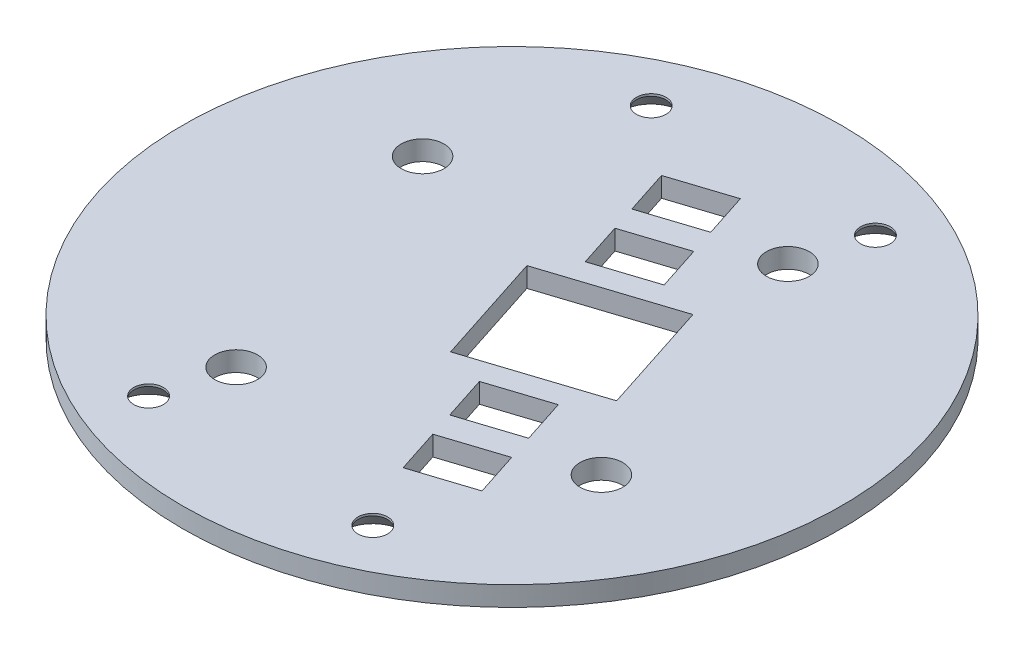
ISO-10303-21;
HEADER;
FILE_DESCRIPTION(('STEP AP214'),'2;1');
FILE_NAME('part.step','',(''),(''),'','','');
FILE_SCHEMA(('AUTOMOTIVE_DESIGN { 1 0 10303 214 1 1 1 1 }'));
ENDSEC;
DATA;
#1=APPLICATION_CONTEXT('core data for automotive mechanical design processes');
#2=APPLICATION_PROTOCOL_DEFINITION('international standard','automotive_design',2000,#1);
#3=PRODUCT_CONTEXT('',#1,'mechanical');
#4=PRODUCT('Part','Part','',(#3));
#5=PRODUCT_RELATED_PRODUCT_CATEGORY('part','',(#4));
#6=PRODUCT_DEFINITION_FORMATION('','',#4);
#7=PRODUCT_DEFINITION_CONTEXT('part definition',#1,'design');
#8=PRODUCT_DEFINITION('design','',#6,#7);
#9=PRODUCT_DEFINITION_SHAPE('','',#8);
#10=(LENGTH_UNIT() NAMED_UNIT(*) SI_UNIT(.MILLI.,.METRE.));
#11=(NAMED_UNIT(*) PLANE_ANGLE_UNIT() SI_UNIT($,.RADIAN.));
#12=(NAMED_UNIT(*) SI_UNIT($,.STERADIAN.) SOLID_ANGLE_UNIT());
#13=UNCERTAINTY_MEASURE_WITH_UNIT(LENGTH_MEASURE(1.E-05),#10,'distance_accuracy_value','');
#14=(GEOMETRIC_REPRESENTATION_CONTEXT(3) GLOBAL_UNCERTAINTY_ASSIGNED_CONTEXT((#13)) GLOBAL_UNIT_ASSIGNED_CONTEXT((#10,
#11,#12)) REPRESENTATION_CONTEXT('',''));
#15=CARTESIAN_POINT('',(0.,0.,0.));
#16=DIRECTION('',(0.,0.,1.));
#17=DIRECTION('',(1.,0.,0.));
#18=AXIS2_PLACEMENT_3D('',#15,#16,#17);
#19=CARTESIAN_POINT('',(0.,1.5,0.));
#20=DIRECTION('',(0.,1.,0.));
#21=DIRECTION('',(0.,0.,1.));
#22=AXIS2_PLACEMENT_3D('',#19,#20,#21);
#23=PLANE('',#22);
#24=DIRECTION('',(0.308303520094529,0.,0.951288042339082));
#25=VECTOR('',#24,1.);
#26=CARTESIAN_POINT('',(13.5874226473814,1.5,-13.8644129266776));
#27=LINE('',#26,#25);
#28=CARTESIAN_POINT('',(13.5874226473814,1.5,-13.8644129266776));
#29=VERTEX_POINT('',#28);
#30=CARTESIAN_POINT('',(19.136886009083,1.5,3.25877183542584));
#31=VERTEX_POINT('',#30);
#32=EDGE_CURVE('E174',#29,#31,#27,.T.);
#33=ORIENTED_EDGE('',*,*,#32,.T.);
#34=DIRECTION('',(-0.951288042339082,0.,0.308303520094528));
#35=VECTOR('',#34,1.);
#36=CARTESIAN_POINT('',(19.136886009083,1.5,3.25877183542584));
#37=LINE('',#36,#35);
#38=CARTESIAN_POINT('',(0.111125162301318,1.5,9.42484223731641));
#39=VERTEX_POINT('',#38);
#40=EDGE_CURVE('E183',#31,#39,#37,.T.);
#41=ORIENTED_EDGE('',*,*,#40,.T.);
#42=DIRECTION('',(-0.308303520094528,0.,-0.951288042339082));
#43=VECTOR('',#42,1.);
#44=CARTESIAN_POINT('',(0.111125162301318,1.5,9.42484223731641));
#45=LINE('',#44,#43);
#46=CARTESIAN_POINT('',(-5.43833819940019,1.5,-7.69834252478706));
#47=VERTEX_POINT('',#46);
#48=EDGE_CURVE('E50',#39,#47,#45,.T.);
#49=ORIENTED_EDGE('',*,*,#48,.T.);
#50=DIRECTION('',(0.951288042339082,0.,-0.308303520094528));
#51=VECTOR('',#50,1.);
#52=CARTESIAN_POINT('',(-5.43833819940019,1.5,-7.69834252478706));
#53=LINE('',#52,#51);
#54=EDGE_CURVE('E180',#47,#29,#53,.T.);
#55=ORIENTED_EDGE('',*,*,#54,.T.);
#56=EDGE_LOOP('',(#33,#41,#49,#55));
#57=FACE_BOUND('',#56,.T.);
#58=CARTESIAN_POINT('',(17.0092592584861,1.5,38.1280421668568));
#59=DIRECTION('',(0.,-1.,0.));
#60=DIRECTION('',(0.,0.,-1.));
#61=AXIS2_PLACEMENT_3D('',#58,#59,#60);
#62=CIRCLE('',#61,2.2479);
#63=CARTESIAN_POINT('',(17.0092592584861,1.5,35.8801421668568));
#64=VERTEX_POINT('',#63);
#65=EDGE_CURVE('E213',#64,#64,#62,.T.);
#66=ORIENTED_EDGE('',*,*,#65,.T.);
#67=EDGE_LOOP('',(#66));
#68=FACE_BOUND('',#67,.T.);
#69=CARTESIAN_POINT('',(-17.0092592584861,1.5,38.1280421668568));
#70=DIRECTION('',(0.,-1.,0.));
#71=DIRECTION('',(0.,0.,-1.));
#72=AXIS2_PLACEMENT_3D('',#69,#70,#71);
#73=CIRCLE('',#72,2.2479);
#74=CARTESIAN_POINT('',(-17.0092592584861,1.5,35.8801421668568));
#75=VERTEX_POINT('',#74);
#76=EDGE_CURVE('E222',#75,#75,#73,.T.);
#77=ORIENTED_EDGE('',*,*,#76,.T.);
#78=EDGE_LOOP('',(#77));
#79=FACE_BOUND('',#78,.T.);
#80=CARTESIAN_POINT('',(-17.009259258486,1.5,-38.1280421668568));
#81=DIRECTION('',(0.,-1.,0.));
#82=DIRECTION('',(0.,0.,-1.));
#83=AXIS2_PLACEMENT_3D('',#80,#81,#82);
#84=CIRCLE('',#83,2.2479);
#85=CARTESIAN_POINT('',(-17.009259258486,1.5,-40.3759421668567));
#86=VERTEX_POINT('',#85);
#87=EDGE_CURVE('E231',#86,#86,#84,.T.);
#88=ORIENTED_EDGE('',*,*,#87,.T.);
#89=EDGE_LOOP('',(#88));
#90=FACE_BOUND('',#89,.T.);
#91=CARTESIAN_POINT('',(0.,1.5,0.));
#92=DIRECTION('',(0.,1.,0.));
#93=DIRECTION('',(0.,0.,1.));
#94=AXIS2_PLACEMENT_3D('',#91,#92,#93);
#95=CIRCLE('',#94,50.);
#96=CARTESIAN_POINT('',(0.,1.5,50.));
#97=VERTEX_POINT('',#96);
#98=EDGE_CURVE('E243',#97,#97,#95,.T.);
#99=ORIENTED_EDGE('',*,*,#98,.T.);
#100=EDGE_LOOP('',(#99));
#101=FACE_BOUND('',#100,.T.);
#102=CARTESIAN_POINT('',(-14.1456594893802,1.5,27.7110143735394));
#103=DIRECTION('',(0.,1.,0.));
#104=DIRECTION('',(0.,0.,1.));
#105=AXIS2_PLACEMENT_3D('',#102,#103,#104);
#106=CIRCLE('',#105,3.25);
#107=CARTESIAN_POINT('',(-14.1456594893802,1.5,30.9610143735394));
#108=VERTEX_POINT('',#107);
#109=EDGE_CURVE('E39',#108,#108,#106,.T.);
#110=ORIENTED_EDGE('',*,*,#109,.F.);
#111=EDGE_LOOP('',(#110));
#112=FACE_BOUND('',#111,.T.);
#113=DIRECTION('',(0.308303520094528,0.,0.951288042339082));
#114=VECTOR('',#113,1.);
#115=CARTESIAN_POINT('',(6.17982515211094,1.5,11.1214875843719));
#116=LINE('',#115,#114);
#117=CARTESIAN_POINT('',(6.17982515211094,1.5,11.1214875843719));
#118=VERTEX_POINT('',#117);
#119=CARTESIAN_POINT('',(8.33794979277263,1.5,17.7805038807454));
#120=VERTEX_POINT('',#119);
#121=EDGE_CURVE('E361',#118,#120,#116,.T.);
#122=ORIENTED_EDGE('',*,*,#121,.F.);
#123=DIRECTION('',(-0.951288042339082,0.,0.308303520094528));
#124=VECTOR('',#123,1.);
#125=CARTESIAN_POINT('',(15.2170615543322,1.5,8.19260414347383));
#126=LINE('',#125,#124);
#127=CARTESIAN_POINT('',(15.2170615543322,1.5,8.19260414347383));
#128=VERTEX_POINT('',#127);
#129=EDGE_CURVE('E368',#128,#118,#126,.T.);
#130=ORIENTED_EDGE('',*,*,#129,.F.);
#131=DIRECTION('',(-0.308303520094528,0.,-0.951288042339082));
#132=VECTOR('',#131,1.);
#133=CARTESIAN_POINT('',(17.3751861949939,1.5,14.8516204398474));
#134=LINE('',#133,#132);
#135=CARTESIAN_POINT('',(17.3751861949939,1.5,14.8516204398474));
#136=VERTEX_POINT('',#135);
#137=EDGE_CURVE('E382',#136,#128,#134,.T.);
#138=ORIENTED_EDGE('',*,*,#137,.F.);
#139=DIRECTION('',(0.951288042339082,0.,-0.308303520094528));
#140=VECTOR('',#139,1.);
#141=CARTESIAN_POINT('',(8.33794979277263,1.5,17.7805038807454));
#142=LINE('',#141,#140);
#143=EDGE_CURVE('E379',#120,#136,#142,.T.);
#144=ORIENTED_EDGE('',*,*,#143,.F.);
#145=EDGE_LOOP('',(#122,#130,#138,#144));
#146=FACE_BOUND('',#145,.T.);
#147=CARTESIAN_POINT('',(-27.7110143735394,1.5,-14.1456594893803));
#148=DIRECTION('',(0.,1.,0.));
#149=DIRECTION('',(0.,0.,1.));
#150=AXIS2_PLACEMENT_3D('',#147,#148,#149);
#151=CIRCLE('',#150,3.25);
#152=CARTESIAN_POINT('',(-27.7110143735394,1.5,-10.8956594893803));
#153=VERTEX_POINT('',#152);
#154=EDGE_CURVE('E355',#153,#153,#151,.T.);
#155=ORIENTED_EDGE('',*,*,#154,.F.);
#156=EDGE_LOOP('',(#155));
#157=FACE_BOUND('',#156,.T.);
#158=CARTESIAN_POINT('',(14.1456594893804,1.5,-27.7110143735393));
#159=DIRECTION('',(0.,1.,0.));
#160=DIRECTION('',(0.,0.,1.));
#161=AXIS2_PLACEMENT_3D('',#158,#159,#160);
#162=CIRCLE('',#161,3.25);
#163=CARTESIAN_POINT('',(14.1456594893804,1.5,-24.4610143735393));
#164=VERTEX_POINT('',#163);
#165=EDGE_CURVE('E349',#164,#164,#162,.T.);
#166=ORIENTED_EDGE('',*,*,#165,.F.);
#167=EDGE_LOOP('',(#166));
#168=FACE_BOUND('',#167,.T.);
#169=CARTESIAN_POINT('',(27.7110143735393,1.5,14.1456594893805));
#170=DIRECTION('',(0.,1.,0.));
#171=DIRECTION('',(0.,0.,1.));
#172=AXIS2_PLACEMENT_3D('',#169,#170,#171);
#173=CIRCLE('',#172,3.25);
#174=CARTESIAN_POINT('',(27.7110143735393,1.5,17.3956594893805));
#175=VERTEX_POINT('',#174);
#176=EDGE_CURVE('E339',#175,#175,#173,.T.);
#177=ORIENTED_EDGE('',*,*,#176,.F.);
#178=EDGE_LOOP('',(#177));
#179=FACE_BOUND('',#178,.T.);
#180=DIRECTION('',(0.308303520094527,0.,0.951288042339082));
#181=VECTOR('',#180,1.);
#182=CARTESIAN_POINT('',(11.7292885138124,1.5,28.2446723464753));
#183=LINE('',#182,#181);
#184=CARTESIAN_POINT('',(9.57116387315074,1.5,21.5856560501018));
#185=VERTEX_POINT('',#184);
#186=CARTESIAN_POINT('',(11.7292885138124,1.5,28.2446723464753));
#187=VERTEX_POINT('',#186);
#188=EDGE_CURVE('E307',#185,#187,#183,.T.);
#189=ORIENTED_EDGE('',*,*,#188,.F.);
#190=DIRECTION('',(-0.951288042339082,0.,0.308303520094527));
#191=VECTOR('',#190,1.);
#192=CARTESIAN_POINT('',(9.57116387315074,1.5,21.5856560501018));
#193=LINE('',#192,#191);
#194=CARTESIAN_POINT('',(18.608400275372,1.5,18.6567726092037));
#195=VERTEX_POINT('',#194);
#196=EDGE_CURVE('E318',#195,#185,#193,.T.);
#197=ORIENTED_EDGE('',*,*,#196,.F.);
#198=DIRECTION('',(-0.308303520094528,0.,-0.951288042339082));
#199=VECTOR('',#198,1.);
#200=CARTESIAN_POINT('',(18.608400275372,1.5,18.6567726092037));
#201=LINE('',#200,#199);
#202=CARTESIAN_POINT('',(20.7665249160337,1.5,25.3157889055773));
#203=VERTEX_POINT('',#202);
#204=EDGE_CURVE('E332',#203,#195,#201,.T.);
#205=ORIENTED_EDGE('',*,*,#204,.F.);
#206=DIRECTION('',(0.951288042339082,0.,-0.308303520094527));
#207=VECTOR('',#206,1.);
#208=CARTESIAN_POINT('',(20.7665249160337,1.5,25.3157889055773));
#209=LINE('',#208,#207);
#210=EDGE_CURVE('E329',#187,#203,#209,.T.);
#211=ORIENTED_EDGE('',*,*,#210,.F.);
#212=EDGE_LOOP('',(#189,#197,#205,#211));
#213=FACE_BOUND('',#212,.T.);
#214=DIRECTION('',(-0.308303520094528,0.,-0.951288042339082));
#215=VECTOR('',#214,1.);
#216=CARTESIAN_POINT('',(5.36059801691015,1.5,-22.2200745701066));
#217=LINE('',#216,#215);
#218=CARTESIAN_POINT('',(7.51872265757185,1.5,-15.5610582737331));
#219=VERTEX_POINT('',#218);
#220=CARTESIAN_POINT('',(5.36059801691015,1.5,-22.2200745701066));
#221=VERTEX_POINT('',#220);
#222=EDGE_CURVE('E275',#219,#221,#217,.T.);
#223=ORIENTED_EDGE('',*,*,#222,.F.);
#224=DIRECTION('',(0.951288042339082,0.,-0.308303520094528));
#225=VECTOR('',#224,1.);
#226=CARTESIAN_POINT('',(7.51872265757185,1.5,-15.5610582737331));
#227=LINE('',#226,#225);
#228=CARTESIAN_POINT('',(-1.51851374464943,1.5,-12.632174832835));
#229=VERTEX_POINT('',#228);
#230=EDGE_CURVE('E286',#229,#219,#227,.T.);
#231=ORIENTED_EDGE('',*,*,#230,.F.);
#232=DIRECTION('',(0.308303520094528,0.,0.951288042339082));
#233=VECTOR('',#232,1.);
#234=CARTESIAN_POINT('',(-1.51851374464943,1.5,-12.632174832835));
#235=LINE('',#234,#233);
#236=CARTESIAN_POINT('',(-3.67663838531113,1.5,-19.2911911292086));
#237=VERTEX_POINT('',#236);
#238=EDGE_CURVE('E300',#237,#229,#235,.T.);
#239=ORIENTED_EDGE('',*,*,#238,.F.);
#240=DIRECTION('',(-0.951288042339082,0.,0.308303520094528));
#241=VECTOR('',#240,1.);
#242=CARTESIAN_POINT('',(-3.67663838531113,1.5,-19.2911911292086));
#243=LINE('',#242,#241);
#244=EDGE_CURVE('E297',#221,#237,#243,.T.);
#245=ORIENTED_EDGE('',*,*,#244,.F.);
#246=EDGE_LOOP('',(#223,#231,#239,#245));
#247=FACE_BOUND('',#246,.T.);
#248=DIRECTION('',(0.308303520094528,0.,0.951288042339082));
#249=VECTOR('',#248,1.);
#250=CARTESIAN_POINT('',(-7.06797710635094,1.5,-29.7553595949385));
#251=LINE('',#250,#249);
#252=CARTESIAN_POINT('',(-7.06797710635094,1.5,-29.7553595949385));
#253=VERTEX_POINT('',#252);
#254=CARTESIAN_POINT('',(-4.90985246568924,1.5,-23.0963432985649));
#255=VERTEX_POINT('',#254);
#256=EDGE_CURVE('E247',#253,#255,#251,.T.);
#257=ORIENTED_EDGE('',*,*,#256,.F.);
#258=DIRECTION('',(-0.951288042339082,0.,0.308303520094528));
#259=VECTOR('',#258,1.);
#260=CARTESIAN_POINT('',(1.96925929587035,1.5,-32.6842430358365));
#261=LINE('',#260,#259);
#262=CARTESIAN_POINT('',(1.96925929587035,1.5,-32.6842430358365));
#263=VERTEX_POINT('',#262);
#264=EDGE_CURVE('E254',#263,#253,#261,.T.);
#265=ORIENTED_EDGE('',*,*,#264,.F.);
#266=DIRECTION('',(-0.308303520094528,0.,-0.951288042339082));
#267=VECTOR('',#266,1.);
#268=CARTESIAN_POINT('',(4.12738393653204,1.5,-26.025226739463));
#269=LINE('',#268,#267);
#270=CARTESIAN_POINT('',(4.12738393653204,1.5,-26.025226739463));
#271=VERTEX_POINT('',#270);
#272=EDGE_CURVE('E268',#271,#263,#269,.T.);
#273=ORIENTED_EDGE('',*,*,#272,.F.);
#274=DIRECTION('',(0.951288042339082,0.,-0.308303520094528));
#275=VECTOR('',#274,1.);
#276=CARTESIAN_POINT('',(-4.90985246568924,1.5,-23.0963432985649));
#277=LINE('',#276,#275);
#278=EDGE_CURVE('E265',#255,#271,#277,.T.);
#279=ORIENTED_EDGE('',*,*,#278,.F.);
#280=EDGE_LOOP('',(#257,#265,#273,#279));
#281=FACE_BOUND('',#280,.T.);
#282=CARTESIAN_POINT('',(17.009259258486,1.5,-38.1280421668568));
#283=DIRECTION('',(0.,-1.,0.));
#284=DIRECTION('',(0.,0.,-1.));
#285=AXIS2_PLACEMENT_3D('',#282,#283,#284);
#286=CIRCLE('',#285,2.2479);
#287=CARTESIAN_POINT('',(17.009259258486,1.5,-40.3759421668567));
#288=VERTEX_POINT('',#287);
#289=EDGE_CURVE('E240',#288,#288,#286,.T.);
#290=ORIENTED_EDGE('',*,*,#289,.T.);
#291=EDGE_LOOP('',(#290));
#292=FACE_BOUND('',#291,.T.);
#293=ADVANCED_FACE('F35',(#57,#68,#79,#90,#101,#112,#146,#157,#168,#179,#213,#247,#281,#292),
#23,.T.);
#294=CARTESIAN_POINT('',(0.,-1.5,0.));
#295=DIRECTION('',(0.,1.,0.));
#296=DIRECTION('',(0.,0.,1.));
#297=AXIS2_PLACEMENT_3D('',#294,#295,#296);
#298=PLANE('',#297);
#299=DIRECTION('',(-0.951288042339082,0.,0.308303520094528));
#300=VECTOR('',#299,1.);
#301=CARTESIAN_POINT('',(19.136886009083,-1.5,3.25877183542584));
#302=LINE('',#301,#300);
#303=CARTESIAN_POINT('',(19.136886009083,-1.5,3.25877183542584));
#304=VERTEX_POINT('',#303);
#305=CARTESIAN_POINT('',(0.111125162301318,-1.5,9.42484223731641));
#306=VERTEX_POINT('',#305);
#307=EDGE_CURVE('E198',#304,#306,#302,.T.);
#308=ORIENTED_EDGE('',*,*,#307,.F.);
#309=DIRECTION('',(0.308303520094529,0.,0.951288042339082));
#310=VECTOR('',#309,1.);
#311=CARTESIAN_POINT('',(13.5874226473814,-1.5,-13.8644129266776));
#312=LINE('',#311,#310);
#313=CARTESIAN_POINT('',(13.5874226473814,-1.5,-13.8644129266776));
#314=VERTEX_POINT('',#313);
#315=EDGE_CURVE('E58',#314,#304,#312,.T.);
#316=ORIENTED_EDGE('',*,*,#315,.F.);
#317=DIRECTION('',(0.951288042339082,0.,-0.308303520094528));
#318=VECTOR('',#317,1.);
#319=CARTESIAN_POINT('',(-5.43833819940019,-1.5,-7.69834252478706));
#320=LINE('',#319,#318);
#321=CARTESIAN_POINT('',(-5.43833819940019,-1.5,-7.69834252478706));
#322=VERTEX_POINT('',#321);
#323=EDGE_CURVE('E189',#322,#314,#320,.T.);
#324=ORIENTED_EDGE('',*,*,#323,.F.);
#325=DIRECTION('',(-0.308303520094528,0.,-0.951288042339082));
#326=VECTOR('',#325,1.);
#327=CARTESIAN_POINT('',(0.111125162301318,-1.5,9.42484223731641));
#328=LINE('',#327,#326);
#329=EDGE_CURVE('E192',#306,#322,#328,.T.);
#330=ORIENTED_EDGE('',*,*,#329,.F.);
#331=EDGE_LOOP('',(#308,#316,#324,#330));
#332=FACE_BOUND('',#331,.T.);
#333=CARTESIAN_POINT('',(17.0092592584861,-1.5,38.1280421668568));
#334=DIRECTION('',(0.,-1.,0.));
#335=DIRECTION('',(0.,0.,-1.));
#336=AXIS2_PLACEMENT_3D('',#333,#334,#335);
#337=CIRCLE('',#336,4.5593);
#338=CARTESIAN_POINT('',(17.0092592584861,-1.5,33.5687421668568));
#339=VERTEX_POINT('',#338);
#340=EDGE_CURVE('E204',#339,#339,#337,.T.);
#341=ORIENTED_EDGE('',*,*,#340,.F.);
#342=EDGE_LOOP('',(#341));
#343=FACE_BOUND('',#342,.T.);
#344=CARTESIAN_POINT('',(-17.0092592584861,-1.5,38.1280421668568));
#345=DIRECTION('',(0.,-1.,0.));
#346=DIRECTION('',(0.,0.,-1.));
#347=AXIS2_PLACEMENT_3D('',#344,#345,#346);
#348=CIRCLE('',#347,4.5593);
#349=CARTESIAN_POINT('',(-17.0092592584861,-1.5,33.5687421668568));
#350=VERTEX_POINT('',#349);
#351=EDGE_CURVE('E216',#350,#350,#348,.T.);
#352=ORIENTED_EDGE('',*,*,#351,.F.);
#353=EDGE_LOOP('',(#352));
#354=FACE_BOUND('',#353,.T.);
#355=CARTESIAN_POINT('',(-17.009259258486,-1.5,-38.1280421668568));
#356=DIRECTION('',(0.,-1.,0.));
#357=DIRECTION('',(0.,0.,-1.));
#358=AXIS2_PLACEMENT_3D('',#355,#356,#357);
#359=CIRCLE('',#358,4.5593);
#360=CARTESIAN_POINT('',(-17.009259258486,-1.5,-42.6873421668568));
#361=VERTEX_POINT('',#360);
#362=EDGE_CURVE('E225',#361,#361,#359,.T.);
#363=ORIENTED_EDGE('',*,*,#362,.F.);
#364=EDGE_LOOP('',(#363));
#365=FACE_BOUND('',#364,.T.);
#366=CARTESIAN_POINT('',(0.,-1.5,0.));
#367=DIRECTION('',(0.,1.,0.));
#368=DIRECTION('',(0.,0.,1.));
#369=AXIS2_PLACEMENT_3D('',#366,#367,#368);
#370=CIRCLE('',#369,50.);
#371=CARTESIAN_POINT('',(0.,-1.5,50.));
#372=VERTEX_POINT('',#371);
#373=EDGE_CURVE('E244',#372,#372,#370,.F.);
#374=ORIENTED_EDGE('',*,*,#373,.T.);
#375=EDGE_LOOP('',(#374));
#376=FACE_BOUND('',#375,.T.);
#377=CARTESIAN_POINT('',(-14.1456594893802,-1.5,27.7110143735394));
#378=DIRECTION('',(0.,1.,0.));
#379=DIRECTION('',(0.,0.,1.));
#380=AXIS2_PLACEMENT_3D('',#377,#378,#379);
#381=CIRCLE('',#380,3.25);
#382=CARTESIAN_POINT('',(-14.1456594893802,-1.5,30.9610143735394));
#383=VERTEX_POINT('',#382);
#384=EDGE_CURVE('E11',#383,#383,#381,.T.);
#385=ORIENTED_EDGE('',*,*,#384,.T.);
#386=EDGE_LOOP('',(#385));
#387=FACE_BOUND('',#386,.T.);
#388=DIRECTION('',(-0.951288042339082,0.,0.308303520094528));
#389=VECTOR('',#388,1.);
#390=CARTESIAN_POINT('',(15.2170615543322,-1.5,8.19260414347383));
#391=LINE('',#390,#389);
#392=CARTESIAN_POINT('',(15.2170615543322,-1.5,8.19260414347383));
#393=VERTEX_POINT('',#392);
#394=CARTESIAN_POINT('',(6.17982515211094,-1.5,11.1214875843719));
#395=VERTEX_POINT('',#394);
#396=EDGE_CURVE('E374',#393,#395,#391,.T.);
#397=ORIENTED_EDGE('',*,*,#396,.T.);
#398=DIRECTION('',(0.308303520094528,0.,0.951288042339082));
#399=VECTOR('',#398,1.);
#400=CARTESIAN_POINT('',(6.17982515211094,-1.5,11.1214875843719));
#401=LINE('',#400,#399);
#402=CARTESIAN_POINT('',(8.33794979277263,-1.5,17.7805038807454));
#403=VERTEX_POINT('',#402);
#404=EDGE_CURVE('E364',#395,#403,#401,.T.);
#405=ORIENTED_EDGE('',*,*,#404,.T.);
#406=DIRECTION('',(0.951288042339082,0.,-0.308303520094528));
#407=VECTOR('',#406,1.);
#408=CARTESIAN_POINT('',(8.33794979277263,-1.5,17.7805038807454));
#409=LINE('',#408,#407);
#410=CARTESIAN_POINT('',(17.3751861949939,-1.5,14.8516204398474));
#411=VERTEX_POINT('',#410);
#412=EDGE_CURVE('E367',#403,#411,#409,.T.);
#413=ORIENTED_EDGE('',*,*,#412,.T.);
#414=DIRECTION('',(-0.308303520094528,0.,-0.951288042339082));
#415=VECTOR('',#414,1.);
#416=CARTESIAN_POINT('',(17.3751861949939,-1.5,14.8516204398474));
#417=LINE('',#416,#415);
#418=EDGE_CURVE('E371',#411,#393,#417,.T.);
#419=ORIENTED_EDGE('',*,*,#418,.T.);
#420=EDGE_LOOP('',(#397,#405,#413,#419));
#421=FACE_BOUND('',#420,.T.);
#422=CARTESIAN_POINT('',(-27.7110143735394,-1.5,-14.1456594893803));
#423=DIRECTION('',(0.,1.,0.));
#424=DIRECTION('',(0.,0.,1.));
#425=AXIS2_PLACEMENT_3D('',#422,#423,#424);
#426=CIRCLE('',#425,3.25);
#427=CARTESIAN_POINT('',(-27.7110143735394,-1.5,-10.8956594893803));
#428=VERTEX_POINT('',#427);
#429=EDGE_CURVE('E358',#428,#428,#426,.T.);
#430=ORIENTED_EDGE('',*,*,#429,.T.);
#431=EDGE_LOOP('',(#430));
#432=FACE_BOUND('',#431,.T.);
#433=CARTESIAN_POINT('',(14.1456594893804,-1.5,-27.7110143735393));
#434=DIRECTION('',(0.,1.,0.));
#435=DIRECTION('',(0.,0.,1.));
#436=AXIS2_PLACEMENT_3D('',#433,#434,#435);
#437=CIRCLE('',#436,3.25);
#438=CARTESIAN_POINT('',(14.1456594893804,-1.5,-24.4610143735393));
#439=VERTEX_POINT('',#438);
#440=EDGE_CURVE('E352',#439,#439,#437,.T.);
#441=ORIENTED_EDGE('',*,*,#440,.T.);
#442=EDGE_LOOP('',(#441));
#443=FACE_BOUND('',#442,.T.);
#444=CARTESIAN_POINT('',(27.7110143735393,-1.5,14.1456594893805));
#445=DIRECTION('',(0.,1.,0.));
#446=DIRECTION('',(0.,0.,1.));
#447=AXIS2_PLACEMENT_3D('',#444,#445,#446);
#448=CIRCLE('',#447,3.25);
#449=CARTESIAN_POINT('',(27.7110143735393,-1.5,17.3956594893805));
#450=VERTEX_POINT('',#449);
#451=EDGE_CURVE('E346',#450,#450,#448,.T.);
#452=ORIENTED_EDGE('',*,*,#451,.T.);
#453=EDGE_LOOP('',(#452));
#454=FACE_BOUND('',#453,.T.);
#455=DIRECTION('',(-0.951288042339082,0.,0.308303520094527));
#456=VECTOR('',#455,1.);
#457=CARTESIAN_POINT('',(9.57116387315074,-1.5,21.5856560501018));
#458=LINE('',#457,#456);
#459=CARTESIAN_POINT('',(18.608400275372,-1.5,18.6567726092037));
#460=VERTEX_POINT('',#459);
#461=CARTESIAN_POINT('',(9.57116387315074,-1.5,21.5856560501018));
#462=VERTEX_POINT('',#461);
#463=EDGE_CURVE('E324',#460,#462,#458,.T.);
#464=ORIENTED_EDGE('',*,*,#463,.T.);
#465=DIRECTION('',(0.308303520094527,0.,0.951288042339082));
#466=VECTOR('',#465,1.);
#467=CARTESIAN_POINT('',(11.7292885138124,-1.5,28.2446723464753));
#468=LINE('',#467,#466);
#469=CARTESIAN_POINT('',(11.7292885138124,-1.5,28.2446723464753));
#470=VERTEX_POINT('',#469);
#471=EDGE_CURVE('E314',#462,#470,#468,.T.);
#472=ORIENTED_EDGE('',*,*,#471,.T.);
#473=DIRECTION('',(0.951288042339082,0.,-0.308303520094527));
#474=VECTOR('',#473,1.);
#475=CARTESIAN_POINT('',(20.7665249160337,-1.5,25.3157889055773));
#476=LINE('',#475,#474);
#477=CARTESIAN_POINT('',(20.7665249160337,-1.5,25.3157889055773));
#478=VERTEX_POINT('',#477);
#479=EDGE_CURVE('E317',#470,#478,#476,.T.);
#480=ORIENTED_EDGE('',*,*,#479,.T.);
#481=DIRECTION('',(-0.308303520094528,0.,-0.951288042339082));
#482=VECTOR('',#481,1.);
#483=CARTESIAN_POINT('',(18.608400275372,-1.5,18.6567726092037));
#484=LINE('',#483,#482);
#485=EDGE_CURVE('E321',#478,#460,#484,.T.);
#486=ORIENTED_EDGE('',*,*,#485,.T.);
#487=EDGE_LOOP('',(#464,#472,#480,#486));
#488=FACE_BOUND('',#487,.T.);
#489=DIRECTION('',(0.951288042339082,0.,-0.308303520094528));
#490=VECTOR('',#489,1.);
#491=CARTESIAN_POINT('',(7.51872265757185,-1.5,-15.5610582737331));
#492=LINE('',#491,#490);
#493=CARTESIAN_POINT('',(-1.51851374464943,-1.5,-12.632174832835));
#494=VERTEX_POINT('',#493);
#495=CARTESIAN_POINT('',(7.51872265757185,-1.5,-15.5610582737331));
#496=VERTEX_POINT('',#495);
#497=EDGE_CURVE('E292',#494,#496,#492,.T.);
#498=ORIENTED_EDGE('',*,*,#497,.T.);
#499=DIRECTION('',(-0.308303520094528,0.,-0.951288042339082));
#500=VECTOR('',#499,1.);
#501=CARTESIAN_POINT('',(5.36059801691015,-1.5,-22.2200745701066));
#502=LINE('',#501,#500);
#503=CARTESIAN_POINT('',(5.36059801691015,-1.5,-22.2200745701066));
#504=VERTEX_POINT('',#503);
#505=EDGE_CURVE('E282',#496,#504,#502,.T.);
#506=ORIENTED_EDGE('',*,*,#505,.T.);
#507=DIRECTION('',(-0.951288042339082,0.,0.308303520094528));
#508=VECTOR('',#507,1.);
#509=CARTESIAN_POINT('',(-3.67663838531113,-1.5,-19.2911911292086));
#510=LINE('',#509,#508);
#511=CARTESIAN_POINT('',(-3.67663838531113,-1.5,-19.2911911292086));
#512=VERTEX_POINT('',#511);
#513=EDGE_CURVE('E285',#504,#512,#510,.T.);
#514=ORIENTED_EDGE('',*,*,#513,.T.);
#515=DIRECTION('',(0.308303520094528,0.,0.951288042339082));
#516=VECTOR('',#515,1.);
#517=CARTESIAN_POINT('',(-1.51851374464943,-1.5,-12.632174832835));
#518=LINE('',#517,#516);
#519=EDGE_CURVE('E289',#512,#494,#518,.T.);
#520=ORIENTED_EDGE('',*,*,#519,.T.);
#521=EDGE_LOOP('',(#498,#506,#514,#520));
#522=FACE_BOUND('',#521,.T.);
#523=DIRECTION('',(-0.951288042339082,0.,0.308303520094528));
#524=VECTOR('',#523,1.);
#525=CARTESIAN_POINT('',(1.96925929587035,-1.5,-32.6842430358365));
#526=LINE('',#525,#524);
#527=CARTESIAN_POINT('',(1.96925929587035,-1.5,-32.6842430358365));
#528=VERTEX_POINT('',#527);
#529=CARTESIAN_POINT('',(-7.06797710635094,-1.5,-29.7553595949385));
#530=VERTEX_POINT('',#529);
#531=EDGE_CURVE('E260',#528,#530,#526,.T.);
#532=ORIENTED_EDGE('',*,*,#531,.T.);
#533=DIRECTION('',(0.308303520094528,0.,0.951288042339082));
#534=VECTOR('',#533,1.);
#535=CARTESIAN_POINT('',(-7.06797710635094,-1.5,-29.7553595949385));
#536=LINE('',#535,#534);
#537=CARTESIAN_POINT('',(-4.90985246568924,-1.5,-23.0963432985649));
#538=VERTEX_POINT('',#537);
#539=EDGE_CURVE('E250',#530,#538,#536,.T.);
#540=ORIENTED_EDGE('',*,*,#539,.T.);
#541=DIRECTION('',(0.951288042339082,0.,-0.308303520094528));
#542=VECTOR('',#541,1.);
#543=CARTESIAN_POINT('',(-4.90985246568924,-1.5,-23.0963432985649));
#544=LINE('',#543,#542);
#545=CARTESIAN_POINT('',(4.12738393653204,-1.5,-26.025226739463));
#546=VERTEX_POINT('',#545);
#547=EDGE_CURVE('E253',#538,#546,#544,.T.);
#548=ORIENTED_EDGE('',*,*,#547,.T.);
#549=DIRECTION('',(-0.308303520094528,0.,-0.951288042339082));
#550=VECTOR('',#549,1.);
#551=CARTESIAN_POINT('',(4.12738393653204,-1.5,-26.025226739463));
#552=LINE('',#551,#550);
#553=EDGE_CURVE('E257',#546,#528,#552,.T.);
#554=ORIENTED_EDGE('',*,*,#553,.T.);
#555=EDGE_LOOP('',(#532,#540,#548,#554));
#556=FACE_BOUND('',#555,.T.);
#557=CARTESIAN_POINT('',(17.009259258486,-1.5,-38.1280421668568));
#558=DIRECTION('',(0.,-1.,0.));
#559=DIRECTION('',(0.,0.,-1.));
#560=AXIS2_PLACEMENT_3D('',#557,#558,#559);
#561=CIRCLE('',#560,4.5593);
#562=CARTESIAN_POINT('',(17.009259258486,-1.5,-42.6873421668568));
#563=VERTEX_POINT('',#562);
#564=EDGE_CURVE('E234',#563,#563,#561,.T.);
#565=ORIENTED_EDGE('',*,*,#564,.F.);
#566=EDGE_LOOP('',(#565));
#567=FACE_BOUND('',#566,.T.);
#568=ADVANCED_FACE('F37',(#332,#343,#354,#365,#376,#387,#421,#432,#443,#454,#488,#522,#556,
#567),#298,.F.);
#569=CARTESIAN_POINT('',(-14.1456594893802,-1.5,27.7110143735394));
#570=DIRECTION('',(0.,1.,0.));
#571=DIRECTION('',(0.,0.,1.));
#572=AXIS2_PLACEMENT_3D('',#569,#570,#571);
#573=CYLINDRICAL_SURFACE('',#572,3.25);
#574=ORIENTED_EDGE('',*,*,#384,.F.);
#575=EDGE_LOOP('',(#574));
#576=FACE_BOUND('',#575,.T.);
#577=ORIENTED_EDGE('',*,*,#109,.T.);
#578=EDGE_LOOP('',(#577));
#579=FACE_BOUND('',#578,.T.);
#580=ADVANCED_FACE('F421',(#576,#579),#573,.F.);
#581=CARTESIAN_POINT('',(6.17982515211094,-1.5,11.1214875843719));
#582=DIRECTION('',(-0.951288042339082,0.,0.308303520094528));
#583=DIRECTION('',(0.308303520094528,0.,0.951288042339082));
#584=AXIS2_PLACEMENT_3D('',#581,#582,#583);
#585=PLANE('',#584);
#586=ORIENTED_EDGE('',*,*,#121,.T.);
#587=DIRECTION('',(0.,1.,0.));
#588=VECTOR('',#587,1.);
#589=CARTESIAN_POINT('',(8.33794979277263,-1.5,17.7805038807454));
#590=LINE('',#589,#588);
#591=EDGE_CURVE('E377',#403,#120,#590,.T.);
#592=ORIENTED_EDGE('',*,*,#591,.F.);
#593=ORIENTED_EDGE('',*,*,#404,.F.);
#594=DIRECTION('',(0.,1.,0.));
#595=VECTOR('',#594,1.);
#596=CARTESIAN_POINT('',(6.17982515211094,-1.5,11.1214875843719));
#597=LINE('',#596,#595);
#598=EDGE_CURVE('E387',#395,#118,#597,.T.);
#599=ORIENTED_EDGE('',*,*,#598,.T.);
#600=EDGE_LOOP('',(#586,#592,#593,#599));
#601=FACE_BOUND('',#600,.T.);
#602=ADVANCED_FACE('F411',(#601),#585,.F.);
#603=CARTESIAN_POINT('',(15.2170615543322,-1.5,8.19260414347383));
#604=DIRECTION('',(-0.308303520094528,0.,-0.951288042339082));
#605=DIRECTION('',(-0.951288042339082,0.,0.308303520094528));
#606=AXIS2_PLACEMENT_3D('',#603,#604,#605);
#607=PLANE('',#606);
#608=ORIENTED_EDGE('',*,*,#129,.T.);
#609=ORIENTED_EDGE('',*,*,#598,.F.);
#610=ORIENTED_EDGE('',*,*,#396,.F.);
#611=DIRECTION('',(0.,1.,0.));
#612=VECTOR('',#611,1.);
#613=CARTESIAN_POINT('',(15.2170615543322,-1.5,8.19260414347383));
#614=LINE('',#613,#612);
#615=EDGE_CURVE('E389',#393,#128,#614,.T.);
#616=ORIENTED_EDGE('',*,*,#615,.T.);
#617=EDGE_LOOP('',(#608,#609,#610,#616));
#618=FACE_BOUND('',#617,.T.);
#619=ADVANCED_FACE('F413',(#618),#607,.F.);
#620=CARTESIAN_POINT('',(17.3751861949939,-1.5,14.8516204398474));
#621=DIRECTION('',(0.951288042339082,0.,-0.308303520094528));
#622=DIRECTION('',(-0.308303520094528,0.,-0.951288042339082));
#623=AXIS2_PLACEMENT_3D('',#620,#621,#622);
#624=PLANE('',#623);
#625=ORIENTED_EDGE('',*,*,#137,.T.);
#626=ORIENTED_EDGE('',*,*,#615,.F.);
#627=ORIENTED_EDGE('',*,*,#418,.F.);
#628=DIRECTION('',(0.,1.,0.));
#629=VECTOR('',#628,1.);
#630=CARTESIAN_POINT('',(17.3751861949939,-1.5,14.8516204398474));
#631=LINE('',#630,#629);
#632=EDGE_CURVE('E391',#411,#136,#631,.T.);
#633=ORIENTED_EDGE('',*,*,#632,.T.);
#634=EDGE_LOOP('',(#625,#626,#627,#633));
#635=FACE_BOUND('',#634,.T.);
#636=ADVANCED_FACE('F407',(#635),#624,.F.);
#637=CARTESIAN_POINT('',(8.33794979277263,-1.5,17.7805038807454));
#638=DIRECTION('',(0.308303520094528,0.,0.951288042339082));
#639=DIRECTION('',(0.951288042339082,0.,-0.308303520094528));
#640=AXIS2_PLACEMENT_3D('',#637,#638,#639);
#641=PLANE('',#640);
#642=ORIENTED_EDGE('',*,*,#143,.T.);
#643=ORIENTED_EDGE('',*,*,#632,.F.);
#644=ORIENTED_EDGE('',*,*,#412,.F.);
#645=ORIENTED_EDGE('',*,*,#591,.T.);
#646=EDGE_LOOP('',(#642,#643,#644,#645));
#647=FACE_BOUND('',#646,.T.);
#648=ADVANCED_FACE('F397',(#647),#641,.F.);
#649=CARTESIAN_POINT('',(-27.7110143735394,-1.5,-14.1456594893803));
#650=DIRECTION('',(0.,1.,0.));
#651=DIRECTION('',(0.,0.,1.));
#652=AXIS2_PLACEMENT_3D('',#649,#650,#651);
#653=CYLINDRICAL_SURFACE('',#652,3.25);
#654=ORIENTED_EDGE('',*,*,#429,.F.);
#655=EDGE_LOOP('',(#654));
#656=FACE_BOUND('',#655,.T.);
#657=ORIENTED_EDGE('',*,*,#154,.T.);
#658=EDGE_LOOP('',(#657));
#659=FACE_BOUND('',#658,.T.);
#660=ADVANCED_FACE('F435',(#656,#659),#653,.F.);
#661=CARTESIAN_POINT('',(14.1456594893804,-1.5,-27.7110143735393));
#662=DIRECTION('',(0.,1.,0.));
#663=DIRECTION('',(0.,0.,1.));
#664=AXIS2_PLACEMENT_3D('',#661,#662,#663);
#665=CYLINDRICAL_SURFACE('',#664,3.25);
#666=ORIENTED_EDGE('',*,*,#440,.F.);
#667=EDGE_LOOP('',(#666));
#668=FACE_BOUND('',#667,.T.);
#669=ORIENTED_EDGE('',*,*,#165,.T.);
#670=EDGE_LOOP('',(#669));
#671=FACE_BOUND('',#670,.T.);
#672=ADVANCED_FACE('F439',(#668,#671),#665,.F.);
#673=CARTESIAN_POINT('',(27.7110143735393,-1.5,14.1456594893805));
#674=DIRECTION('',(0.,1.,0.));
#675=DIRECTION('',(0.,0.,1.));
#676=AXIS2_PLACEMENT_3D('',#673,#674,#675);
#677=CYLINDRICAL_SURFACE('',#676,3.25);
#678=ORIENTED_EDGE('',*,*,#451,.F.);
#679=EDGE_LOOP('',(#678));
#680=FACE_BOUND('',#679,.T.);
#681=ORIENTED_EDGE('',*,*,#176,.T.);
#682=EDGE_LOOP('',(#681));
#683=FACE_BOUND('',#682,.T.);
#684=ADVANCED_FACE('F444',(#680,#683),#677,.F.);
#685=CARTESIAN_POINT('',(11.7292885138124,-1.5,28.2446723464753));
#686=DIRECTION('',(-0.951288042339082,0.,0.308303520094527));
#687=DIRECTION('',(0.308303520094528,0.,0.951288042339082));
#688=AXIS2_PLACEMENT_3D('',#685,#686,#687);
#689=PLANE('',#688);
#690=ORIENTED_EDGE('',*,*,#188,.T.);
#691=DIRECTION('',(0.,1.,0.));
#692=VECTOR('',#691,1.);
#693=CARTESIAN_POINT('',(11.7292885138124,-1.5,28.2446723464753));
#694=LINE('',#693,#692);
#695=EDGE_CURVE('E327',#470,#187,#694,.T.);
#696=ORIENTED_EDGE('',*,*,#695,.F.);
#697=ORIENTED_EDGE('',*,*,#471,.F.);
#698=DIRECTION('',(0.,1.,0.));
#699=VECTOR('',#698,1.);
#700=CARTESIAN_POINT('',(9.57116387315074,-1.5,21.5856560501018));
#701=LINE('',#700,#699);
#702=EDGE_CURVE('E337',#462,#185,#701,.T.);
#703=ORIENTED_EDGE('',*,*,#702,.T.);
#704=EDGE_LOOP('',(#690,#696,#697,#703));
#705=FACE_BOUND('',#704,.T.);
#706=ADVANCED_FACE('F452',(#705),#689,.F.);
#707=CARTESIAN_POINT('',(9.57116387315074,-1.5,21.5856560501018));
#708=DIRECTION('',(-0.308303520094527,0.,-0.951288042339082));
#709=DIRECTION('',(-0.951288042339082,0.,0.308303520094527));
#710=AXIS2_PLACEMENT_3D('',#707,#708,#709);
#711=PLANE('',#710);
#712=ORIENTED_EDGE('',*,*,#196,.T.);
#713=ORIENTED_EDGE('',*,*,#702,.F.);
#714=ORIENTED_EDGE('',*,*,#463,.F.);
#715=DIRECTION('',(0.,1.,0.));
#716=VECTOR('',#715,1.);
#717=CARTESIAN_POINT('',(18.608400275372,-1.5,18.6567726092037));
#718=LINE('',#717,#716);
#719=EDGE_CURVE('E340',#460,#195,#718,.T.);
#720=ORIENTED_EDGE('',*,*,#719,.T.);
#721=EDGE_LOOP('',(#712,#713,#714,#720));
#722=FACE_BOUND('',#721,.T.);
#723=ADVANCED_FACE('F456',(#722),#711,.F.);
#724=CARTESIAN_POINT('',(18.608400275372,-1.5,18.6567726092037));
#725=DIRECTION('',(0.951288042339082,0.,-0.308303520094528));
#726=DIRECTION('',(-0.308303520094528,0.,-0.951288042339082));
#727=AXIS2_PLACEMENT_3D('',#724,#725,#726);
#728=PLANE('',#727);
#729=ORIENTED_EDGE('',*,*,#204,.T.);
#730=ORIENTED_EDGE('',*,*,#719,.F.);
#731=ORIENTED_EDGE('',*,*,#485,.F.);
#732=DIRECTION('',(0.,1.,0.));
#733=VECTOR('',#732,1.);
#734=CARTESIAN_POINT('',(20.7665249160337,-1.5,25.3157889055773));
#735=LINE('',#734,#733);
#736=EDGE_CURVE('E342',#478,#203,#735,.T.);
#737=ORIENTED_EDGE('',*,*,#736,.T.);
#738=EDGE_LOOP('',(#729,#730,#731,#737));
#739=FACE_BOUND('',#738,.T.);
#740=ADVANCED_FACE('F462',(#739),#728,.F.);
#741=CARTESIAN_POINT('',(20.7665249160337,-1.5,25.3157889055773));
#742=DIRECTION('',(0.308303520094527,0.,0.951288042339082));
#743=DIRECTION('',(0.951288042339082,0.,-0.308303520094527));
#744=AXIS2_PLACEMENT_3D('',#741,#742,#743);
#745=PLANE('',#744);
#746=ORIENTED_EDGE('',*,*,#210,.T.);
#747=ORIENTED_EDGE('',*,*,#736,.F.);
#748=ORIENTED_EDGE('',*,*,#479,.F.);
#749=ORIENTED_EDGE('',*,*,#695,.T.);
#750=EDGE_LOOP('',(#746,#747,#748,#749));
#751=FACE_BOUND('',#750,.T.);
#752=ADVANCED_FACE('F458',(#751),#745,.F.);
#753=CARTESIAN_POINT('',(5.36059801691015,-1.5,-22.2200745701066));
#754=DIRECTION('',(0.951288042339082,0.,-0.308303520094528));
#755=DIRECTION('',(-0.308303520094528,0.,-0.951288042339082));
#756=AXIS2_PLACEMENT_3D('',#753,#754,#755);
#757=PLANE('',#756);
#758=ORIENTED_EDGE('',*,*,#222,.T.);
#759=DIRECTION('',(0.,1.,0.));
#760=VECTOR('',#759,1.);
#761=CARTESIAN_POINT('',(5.36059801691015,-1.5,-22.2200745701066));
#762=LINE('',#761,#760);
#763=EDGE_CURVE('E295',#504,#221,#762,.T.);
#764=ORIENTED_EDGE('',*,*,#763,.F.);
#765=ORIENTED_EDGE('',*,*,#505,.F.);
#766=DIRECTION('',(0.,1.,0.));
#767=VECTOR('',#766,1.);
#768=CARTESIAN_POINT('',(7.51872265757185,-1.5,-15.5610582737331));
#769=LINE('',#768,#767);
#770=EDGE_CURVE('E305',#496,#219,#769,.T.);
#771=ORIENTED_EDGE('',*,*,#770,.T.);
#772=EDGE_LOOP('',(#758,#764,#765,#771));
#773=FACE_BOUND('',#772,.T.);
#774=ADVANCED_FACE('F461',(#773),#757,.F.);
#775=CARTESIAN_POINT('',(7.51872265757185,-1.5,-15.5610582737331));
#776=DIRECTION('',(0.308303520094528,0.,0.951288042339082));
#777=DIRECTION('',(0.951288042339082,0.,-0.308303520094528));
#778=AXIS2_PLACEMENT_3D('',#775,#776,#777);
#779=PLANE('',#778);
#780=ORIENTED_EDGE('',*,*,#230,.T.);
#781=ORIENTED_EDGE('',*,*,#770,.F.);
#782=ORIENTED_EDGE('',*,*,#497,.F.);
#783=DIRECTION('',(0.,1.,0.));
#784=VECTOR('',#783,1.);
#785=CARTESIAN_POINT('',(-1.51851374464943,-1.5,-12.632174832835));
#786=LINE('',#785,#784);
#787=EDGE_CURVE('E308',#494,#229,#786,.T.);
#788=ORIENTED_EDGE('',*,*,#787,.T.);
#789=EDGE_LOOP('',(#780,#781,#782,#788));
#790=FACE_BOUND('',#789,.T.);
#791=ADVANCED_FACE('F472',(#790),#779,.F.);
#792=CARTESIAN_POINT('',(-1.51851374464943,-1.5,-12.632174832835));
#793=DIRECTION('',(-0.951288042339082,0.,0.308303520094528));
#794=DIRECTION('',(0.308303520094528,0.,0.951288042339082));
#795=AXIS2_PLACEMENT_3D('',#792,#793,#794);
#796=PLANE('',#795);
#797=ORIENTED_EDGE('',*,*,#238,.T.);
#798=ORIENTED_EDGE('',*,*,#787,.F.);
#799=ORIENTED_EDGE('',*,*,#519,.F.);
#800=DIRECTION('',(0.,1.,0.));
#801=VECTOR('',#800,1.);
#802=CARTESIAN_POINT('',(-3.67663838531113,-1.5,-19.2911911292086));
#803=LINE('',#802,#801);
#804=EDGE_CURVE('E310',#512,#237,#803,.T.);
#805=ORIENTED_EDGE('',*,*,#804,.T.);
#806=EDGE_LOOP('',(#797,#798,#799,#805));
#807=FACE_BOUND('',#806,.T.);
#808=ADVANCED_FACE('F478',(#807),#796,.F.);
#809=CARTESIAN_POINT('',(-3.67663838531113,-1.5,-19.2911911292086));
#810=DIRECTION('',(-0.308303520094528,0.,-0.951288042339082));
#811=DIRECTION('',(-0.951288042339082,0.,0.308303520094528));
#812=AXIS2_PLACEMENT_3D('',#809,#810,#811);
#813=PLANE('',#812);
#814=ORIENTED_EDGE('',*,*,#244,.T.);
#815=ORIENTED_EDGE('',*,*,#804,.F.);
#816=ORIENTED_EDGE('',*,*,#513,.F.);
#817=ORIENTED_EDGE('',*,*,#763,.T.);
#818=EDGE_LOOP('',(#814,#815,#816,#817));
#819=FACE_BOUND('',#818,.T.);
#820=ADVANCED_FACE('F474',(#819),#813,.F.);
#821=CARTESIAN_POINT('',(-7.06797710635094,-1.5,-29.7553595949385));
#822=DIRECTION('',(-0.951288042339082,0.,0.308303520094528));
#823=DIRECTION('',(0.308303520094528,0.,0.951288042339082));
#824=AXIS2_PLACEMENT_3D('',#821,#822,#823);
#825=PLANE('',#824);
#826=ORIENTED_EDGE('',*,*,#256,.T.);
#827=DIRECTION('',(0.,1.,0.));
#828=VECTOR('',#827,1.);
#829=CARTESIAN_POINT('',(-4.90985246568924,-1.5,-23.0963432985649));
#830=LINE('',#829,#828);
#831=EDGE_CURVE('E263',#538,#255,#830,.T.);
#832=ORIENTED_EDGE('',*,*,#831,.F.);
#833=ORIENTED_EDGE('',*,*,#539,.F.);
#834=DIRECTION('',(0.,1.,0.));
#835=VECTOR('',#834,1.);
#836=CARTESIAN_POINT('',(-7.06797710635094,-1.5,-29.7553595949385));
#837=LINE('',#836,#835);
#838=EDGE_CURVE('E273',#530,#253,#837,.T.);
#839=ORIENTED_EDGE('',*,*,#838,.T.);
#840=EDGE_LOOP('',(#826,#832,#833,#839));
#841=FACE_BOUND('',#840,.T.);
#842=ADVANCED_FACE('F477',(#841),#825,.F.);
#843=CARTESIAN_POINT('',(1.96925929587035,-1.5,-32.6842430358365));
#844=DIRECTION('',(-0.308303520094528,0.,-0.951288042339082));
#845=DIRECTION('',(-0.951288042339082,0.,0.308303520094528));
#846=AXIS2_PLACEMENT_3D('',#843,#844,#845);
#847=PLANE('',#846);
#848=ORIENTED_EDGE('',*,*,#264,.T.);
#849=ORIENTED_EDGE('',*,*,#838,.F.);
#850=ORIENTED_EDGE('',*,*,#531,.F.);
#851=DIRECTION('',(0.,1.,0.));
#852=VECTOR('',#851,1.);
#853=CARTESIAN_POINT('',(1.96925929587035,-1.5,-32.6842430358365));
#854=LINE('',#853,#852);
#855=EDGE_CURVE('E276',#528,#263,#854,.T.);
#856=ORIENTED_EDGE('',*,*,#855,.T.);
#857=EDGE_LOOP('',(#848,#849,#850,#856));
#858=FACE_BOUND('',#857,.T.);
#859=ADVANCED_FACE('F488',(#858),#847,.F.);
#860=CARTESIAN_POINT('',(4.12738393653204,-1.5,-26.025226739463));
#861=DIRECTION('',(0.951288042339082,0.,-0.308303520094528));
#862=DIRECTION('',(-0.308303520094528,0.,-0.951288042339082));
#863=AXIS2_PLACEMENT_3D('',#860,#861,#862);
#864=PLANE('',#863);
#865=ORIENTED_EDGE('',*,*,#272,.T.);
#866=ORIENTED_EDGE('',*,*,#855,.F.);
#867=ORIENTED_EDGE('',*,*,#553,.F.);
#868=DIRECTION('',(0.,1.,0.));
#869=VECTOR('',#868,1.);
#870=CARTESIAN_POINT('',(4.12738393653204,-1.5,-26.025226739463));
#871=LINE('',#870,#869);
#872=EDGE_CURVE('E278',#546,#271,#871,.T.);
#873=ORIENTED_EDGE('',*,*,#872,.T.);
#874=EDGE_LOOP('',(#865,#866,#867,#873));
#875=FACE_BOUND('',#874,.T.);
#876=ADVANCED_FACE('F494',(#875),#864,.F.);
#877=CARTESIAN_POINT('',(-4.90985246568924,-1.5,-23.0963432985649));
#878=DIRECTION('',(0.308303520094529,0.,0.951288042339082));
#879=DIRECTION('',(0.951288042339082,0.,-0.308303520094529));
#880=AXIS2_PLACEMENT_3D('',#877,#878,#879);
#881=PLANE('',#880);
#882=ORIENTED_EDGE('',*,*,#278,.T.);
#883=ORIENTED_EDGE('',*,*,#872,.F.);
#884=ORIENTED_EDGE('',*,*,#547,.F.);
#885=ORIENTED_EDGE('',*,*,#831,.T.);
#886=EDGE_LOOP('',(#882,#883,#884,#885));
#887=FACE_BOUND('',#886,.T.);
#888=ADVANCED_FACE('F490',(#887),#881,.F.);
#889=CARTESIAN_POINT('',(0.,-142.92135623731,0.));
#890=DIRECTION('',(0.,1.,0.));
#891=DIRECTION('',(0.,0.,1.));
#892=AXIS2_PLACEMENT_3D('',#889,#890,#891);
#893=CYLINDRICAL_SURFACE('',#892,50.);
#894=ORIENTED_EDGE('',*,*,#373,.F.);
#895=EDGE_LOOP('',(#894));
#896=FACE_BOUND('',#895,.T.);
#897=ORIENTED_EDGE('',*,*,#98,.F.);
#898=EDGE_LOOP('',(#897));
#899=FACE_BOUND('',#898,.T.);
#900=ADVANCED_FACE('F493',(#896,#899),#893,.T.);
#901=CARTESIAN_POINT('',(17.009259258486,-1.5,-38.1280421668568));
#902=DIRECTION('',(0.,-1.,0.));
#903=DIRECTION('',(0.,0.,-1.));
#904=AXIS2_PLACEMENT_3D('',#901,#902,#903);
#905=CYLINDRICAL_SURFACE('',#904,2.24789999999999);
#906=ORIENTED_EDGE('',*,*,#289,.F.);
#907=EDGE_LOOP('',(#906));
#908=FACE_BOUND('',#907,.T.);
#909=CARTESIAN_POINT('',(17.009259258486,1.15896153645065,-38.1280421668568));
#910=DIRECTION('',(0.,-1.,0.));
#911=DIRECTION('',(0.,0.,-1.));
#912=AXIS2_PLACEMENT_3D('',#909,#910,#911);
#913=CIRCLE('',#912,2.24789999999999);
#914=CARTESIAN_POINT('',(17.009259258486,1.15896153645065,-40.3759421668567));
#915=VERTEX_POINT('',#914);
#916=EDGE_CURVE('E237',#915,#915,#913,.T.);
#917=ORIENTED_EDGE('',*,*,#916,.T.);
#918=EDGE_LOOP('',(#917));
#919=FACE_BOUND('',#918,.T.);
#920=ADVANCED_FACE('F504',(#908,#919),#905,.F.);
#921=CARTESIAN_POINT('',(17.009259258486,-1.5,-38.1280421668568));
#922=DIRECTION('',(0.,-1.,0.));
#923=DIRECTION('',(0.,0.,-1.));
#924=AXIS2_PLACEMENT_3D('',#921,#922,#923);
#925=CONICAL_SURFACE('',#924,4.5593,0.715584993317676);
#926=ORIENTED_EDGE('',*,*,#916,.F.);
#927=EDGE_LOOP('',(#926));
#928=FACE_BOUND('',#927,.T.);
#929=ORIENTED_EDGE('',*,*,#564,.T.);
#930=EDGE_LOOP('',(#929));
#931=FACE_BOUND('',#930,.T.);
#932=ADVANCED_FACE('F508',(#928,#931),#925,.F.);
#933=CARTESIAN_POINT('',(-17.009259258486,-1.5,-38.1280421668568));
#934=DIRECTION('',(0.,-1.,0.));
#935=DIRECTION('',(0.,0.,-1.));
#936=AXIS2_PLACEMENT_3D('',#933,#934,#935);
#937=CYLINDRICAL_SURFACE('',#936,2.24789999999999);
#938=ORIENTED_EDGE('',*,*,#87,.F.);
#939=EDGE_LOOP('',(#938));
#940=FACE_BOUND('',#939,.T.);
#941=CARTESIAN_POINT('',(-17.009259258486,1.15896153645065,-38.1280421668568));
#942=DIRECTION('',(0.,-1.,0.));
#943=DIRECTION('',(0.,0.,-1.));
#944=AXIS2_PLACEMENT_3D('',#941,#942,#943);
#945=CIRCLE('',#944,2.24789999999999);
#946=CARTESIAN_POINT('',(-17.009259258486,1.15896153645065,-40.3759421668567));
#947=VERTEX_POINT('',#946);
#948=EDGE_CURVE('E228',#947,#947,#945,.T.);
#949=ORIENTED_EDGE('',*,*,#948,.T.);
#950=EDGE_LOOP('',(#949));
#951=FACE_BOUND('',#950,.T.);
#952=ADVANCED_FACE('F512',(#940,#951),#937,.F.);
#953=CARTESIAN_POINT('',(-17.009259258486,-1.5,-38.1280421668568));
#954=DIRECTION('',(0.,-1.,0.));
#955=DIRECTION('',(0.,0.,-1.));
#956=AXIS2_PLACEMENT_3D('',#953,#954,#955);
#957=CONICAL_SURFACE('',#956,4.5593,0.715584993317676);
#958=ORIENTED_EDGE('',*,*,#948,.F.);
#959=EDGE_LOOP('',(#958));
#960=FACE_BOUND('',#959,.T.);
#961=ORIENTED_EDGE('',*,*,#362,.T.);
#962=EDGE_LOOP('',(#961));
#963=FACE_BOUND('',#962,.T.);
#964=ADVANCED_FACE('F516',(#960,#963),#957,.F.);
#965=CARTESIAN_POINT('',(-17.0092592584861,-1.5,38.1280421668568));
#966=DIRECTION('',(0.,-1.,0.));
#967=DIRECTION('',(0.,0.,-1.));
#968=AXIS2_PLACEMENT_3D('',#965,#966,#967);
#969=CYLINDRICAL_SURFACE('',#968,2.24789999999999);
#970=ORIENTED_EDGE('',*,*,#76,.F.);
#971=EDGE_LOOP('',(#970));
#972=FACE_BOUND('',#971,.T.);
#973=CARTESIAN_POINT('',(-17.0092592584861,1.15896153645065,38.1280421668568));
#974=DIRECTION('',(0.,-1.,0.));
#975=DIRECTION('',(0.,0.,-1.));
#976=AXIS2_PLACEMENT_3D('',#973,#974,#975);
#977=CIRCLE('',#976,2.24789999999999);
#978=CARTESIAN_POINT('',(-17.0092592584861,1.15896153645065,35.8801421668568));
#979=VERTEX_POINT('',#978);
#980=EDGE_CURVE('E219',#979,#979,#977,.T.);
#981=ORIENTED_EDGE('',*,*,#980,.T.);
#982=EDGE_LOOP('',(#981));
#983=FACE_BOUND('',#982,.T.);
#984=ADVANCED_FACE('F520',(#972,#983),#969,.F.);
#985=CARTESIAN_POINT('',(-17.0092592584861,-1.5,38.1280421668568));
#986=DIRECTION('',(0.,-1.,0.));
#987=DIRECTION('',(0.,0.,-1.));
#988=AXIS2_PLACEMENT_3D('',#985,#986,#987);
#989=CONICAL_SURFACE('',#988,4.5593,0.715584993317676);
#990=ORIENTED_EDGE('',*,*,#980,.F.);
#991=EDGE_LOOP('',(#990));
#992=FACE_BOUND('',#991,.T.);
#993=ORIENTED_EDGE('',*,*,#351,.T.);
#994=EDGE_LOOP('',(#993));
#995=FACE_BOUND('',#994,.T.);
#996=ADVANCED_FACE('F524',(#992,#995),#989,.F.);
#997=CARTESIAN_POINT('',(17.0092592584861,-1.5,38.1280421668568));
#998=DIRECTION('',(0.,-1.,0.));
#999=DIRECTION('',(0.,0.,-1.));
#1000=AXIS2_PLACEMENT_3D('',#997,#998,#999);
#1001=CYLINDRICAL_SURFACE('',#1000,2.24789999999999);
#1002=ORIENTED_EDGE('',*,*,#65,.F.);
#1003=EDGE_LOOP('',(#1002));
#1004=FACE_BOUND('',#1003,.T.);
#1005=CARTESIAN_POINT('',(17.0092592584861,1.15896153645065,38.1280421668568));
#1006=DIRECTION('',(0.,-1.,0.));
#1007=DIRECTION('',(0.,0.,-1.));
#1008=AXIS2_PLACEMENT_3D('',#1005,#1006,#1007);
#1009=CIRCLE('',#1008,2.24789999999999);
#1010=CARTESIAN_POINT('',(17.0092592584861,1.15896153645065,35.8801421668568));
#1011=VERTEX_POINT('',#1010);
#1012=EDGE_CURVE('E210',#1011,#1011,#1009,.T.);
#1013=ORIENTED_EDGE('',*,*,#1012,.T.);
#1014=EDGE_LOOP('',(#1013));
#1015=FACE_BOUND('',#1014,.T.);
#1016=ADVANCED_FACE('F528',(#1004,#1015),#1001,.F.);
#1017=CARTESIAN_POINT('',(17.0092592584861,-1.5,38.1280421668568));
#1018=DIRECTION('',(0.,-1.,0.));
#1019=DIRECTION('',(0.,0.,-1.));
#1020=AXIS2_PLACEMENT_3D('',#1017,#1018,#1019);
#1021=CONICAL_SURFACE('',#1020,4.5593,0.715584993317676);
#1022=ORIENTED_EDGE('',*,*,#1012,.F.);
#1023=EDGE_LOOP('',(#1022));
#1024=FACE_BOUND('',#1023,.T.);
#1025=ORIENTED_EDGE('',*,*,#340,.T.);
#1026=EDGE_LOOP('',(#1025));
#1027=FACE_BOUND('',#1026,.T.);
#1028=ADVANCED_FACE('F532',(#1024,#1027),#1021,.F.);
#1029=CARTESIAN_POINT('',(13.5874226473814,1.5,-13.8644129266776));
#1030=DIRECTION('',(0.951288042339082,0.,-0.308303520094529));
#1031=DIRECTION('',(-0.308303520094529,0.,-0.951288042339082));
#1032=AXIS2_PLACEMENT_3D('',#1029,#1030,#1031);
#1033=PLANE('',#1032);
#1034=ORIENTED_EDGE('',*,*,#315,.T.);
#1035=DIRECTION('',(0.,-1.,0.));
#1036=VECTOR('',#1035,1.);
#1037=CARTESIAN_POINT('',(19.136886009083,1.5,3.25877183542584));
#1038=LINE('',#1037,#1036);
#1039=EDGE_CURVE('E170',#31,#304,#1038,.T.);
#1040=ORIENTED_EDGE('',*,*,#1039,.F.);
#1041=ORIENTED_EDGE('',*,*,#32,.F.);
#1042=DIRECTION('',(0.,-1.,0.));
#1043=VECTOR('',#1042,1.);
#1044=CARTESIAN_POINT('',(13.5874226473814,1.5,-13.8644129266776));
#1045=LINE('',#1044,#1043);
#1046=EDGE_CURVE('E202',#29,#314,#1045,.T.);
#1047=ORIENTED_EDGE('',*,*,#1046,.T.);
#1048=EDGE_LOOP('',(#1034,#1040,#1041,#1047));
#1049=FACE_BOUND('',#1048,.T.);
#1050=ADVANCED_FACE('F172',(#1049),#1033,.F.);
#1051=CARTESIAN_POINT('',(-5.43833819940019,1.5,-7.69834252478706));
#1052=DIRECTION('',(-0.308303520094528,0.,-0.951288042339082));
#1053=DIRECTION('',(-0.951288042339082,0.,0.308303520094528));
#1054=AXIS2_PLACEMENT_3D('',#1051,#1052,#1053);
#1055=PLANE('',#1054);
#1056=ORIENTED_EDGE('',*,*,#323,.T.);
#1057=ORIENTED_EDGE('',*,*,#1046,.F.);
#1058=ORIENTED_EDGE('',*,*,#54,.F.);
#1059=DIRECTION('',(0.,-1.,0.));
#1060=VECTOR('',#1059,1.);
#1061=CARTESIAN_POINT('',(-5.43833819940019,1.5,-7.69834252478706));
#1062=LINE('',#1061,#1060);
#1063=EDGE_CURVE('E205',#47,#322,#1062,.T.);
#1064=ORIENTED_EDGE('',*,*,#1063,.T.);
#1065=EDGE_LOOP('',(#1056,#1057,#1058,#1064));
#1066=FACE_BOUND('',#1065,.T.);
#1067=ADVANCED_FACE('F539',(#1066),#1055,.F.);
#1068=CARTESIAN_POINT('',(0.111125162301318,1.5,9.42484223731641));
#1069=DIRECTION('',(-0.951288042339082,0.,0.308303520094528));
#1070=DIRECTION('',(0.308303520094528,0.,0.951288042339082));
#1071=AXIS2_PLACEMENT_3D('',#1068,#1069,#1070);
#1072=PLANE('',#1071);
#1073=ORIENTED_EDGE('',*,*,#329,.T.);
#1074=ORIENTED_EDGE('',*,*,#1063,.F.);
#1075=ORIENTED_EDGE('',*,*,#48,.F.);
#1076=DIRECTION('',(0.,-1.,0.));
#1077=VECTOR('',#1076,1.);
#1078=CARTESIAN_POINT('',(0.111125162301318,1.5,9.42484223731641));
#1079=LINE('',#1078,#1077);
#1080=EDGE_CURVE('E179',#39,#306,#1079,.T.);
#1081=ORIENTED_EDGE('',*,*,#1080,.T.);
#1082=EDGE_LOOP('',(#1073,#1074,#1075,#1081));
#1083=FACE_BOUND('',#1082,.T.);
#1084=ADVANCED_FACE('F542',(#1083),#1072,.F.);
#1085=CARTESIAN_POINT('',(19.136886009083,1.5,3.25877183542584));
#1086=DIRECTION('',(0.308303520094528,0.,0.951288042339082));
#1087=DIRECTION('',(0.951288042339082,0.,-0.308303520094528));
#1088=AXIS2_PLACEMENT_3D('',#1085,#1086,#1087);
#1089=PLANE('',#1088);
#1090=ORIENTED_EDGE('',*,*,#307,.T.);
#1091=ORIENTED_EDGE('',*,*,#1080,.F.);
#1092=ORIENTED_EDGE('',*,*,#40,.F.);
#1093=ORIENTED_EDGE('',*,*,#1039,.T.);
#1094=EDGE_LOOP('',(#1090,#1091,#1092,#1093));
#1095=FACE_BOUND('',#1094,.T.);
#1096=ADVANCED_FACE('F184',(#1095),#1089,.F.);
#1097=CLOSED_SHELL('',(#293,#568,#580,#602,#619,#636,#648,#660,#672,#684,#706,#723,#740,#752,
#774,#791,#808,#820,#842,#859,#876,#888,#900,#920,#932,#952,#964,#984,#996,#1016,#1028,#1050,
#1067,#1084,#1096));
#1098=MANIFOLD_SOLID_BREP('B2',#1097);
#1099=ADVANCED_BREP_SHAPE_REPRESENTATION('',(#18,#1098),#14);
#1100=SHAPE_DEFINITION_REPRESENTATION(#9,#1099);
ENDSEC;
END-ISO-10303-21;
